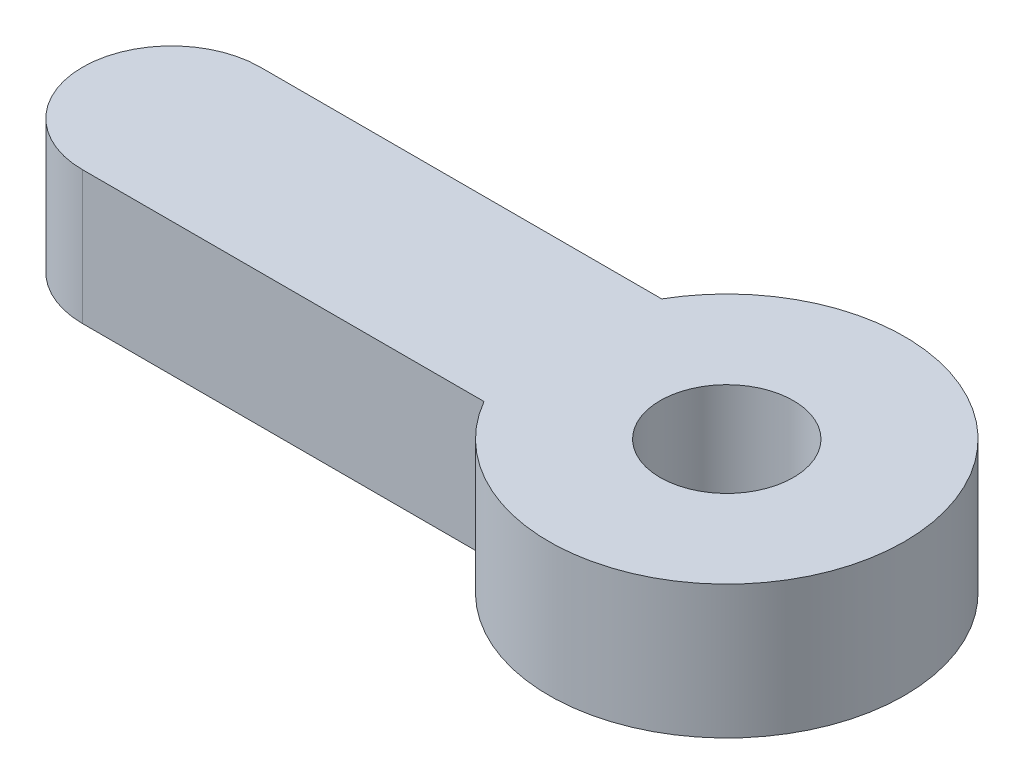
from build123d import *

# Parameters (mm, degrees)
SKETCH1_R      = 3
EXTRUDE1_DEPTH = 6


with BuildPart() as part:
    # Sketch1 → Extrude1 (new body)
    with BuildSketch(Plane(origin=(0, 0, 0), x_dir=(1, 0, 0), z_dir=(0, 1, 0))):
        with BuildLine():
            Line((0, 4), (18.07179677, 4))
            ThreePointArc((18.07179677, 4), (33, 0), (18.07179677, -4))
            Line((18.07179677, -4), (0, -4))
            ThreePointArc((0, -4), (-4, 0), (0, 4))
        make_face()
        with Locations(Location((25, 0, 0), (0, 0, 270))):
            Circle(SKETCH1_R, mode=Mode.SUBTRACT)
    extrude(amount=EXTRUDE1_DEPTH)


solid = part.part
